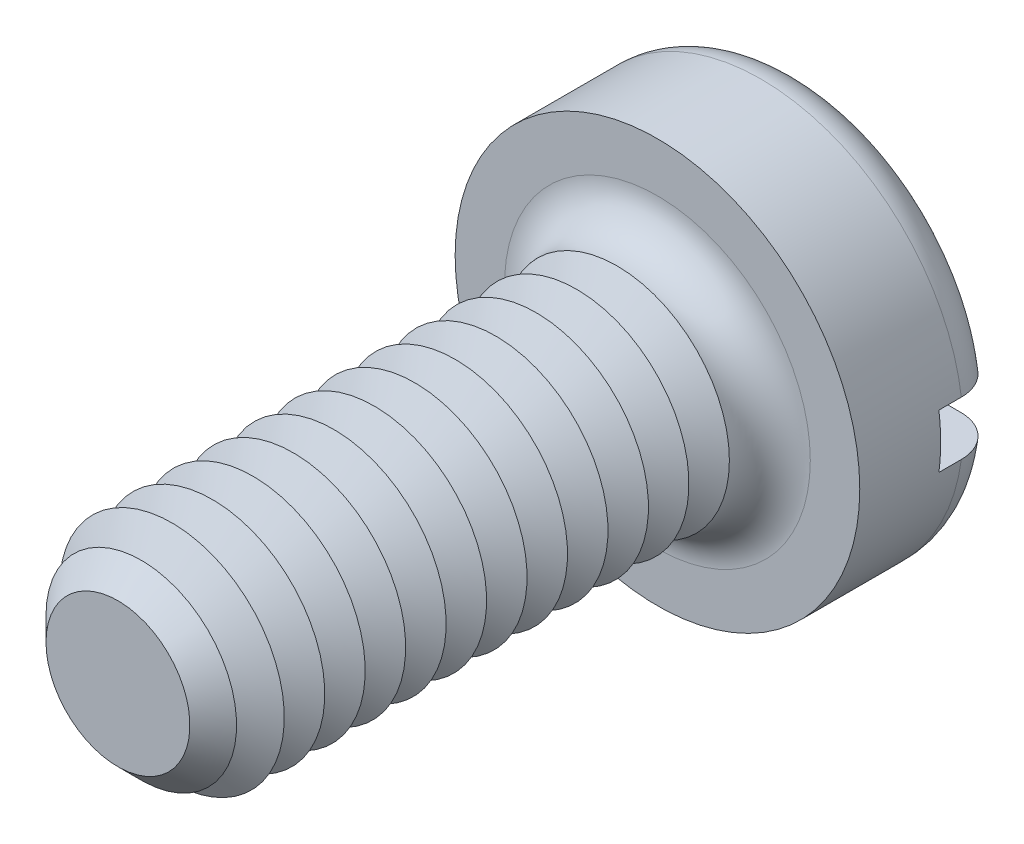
from build123d import *

# Parameters (mm, degrees)
SKETCH3_R           = 2.25
BOSS_EXTRUDE2_DEPTH = 1.6
SKETCH4_R           = 1.25
BOSS_EXTRUDE3_DEPTH = 6
FILLET1_R           = 0.45
CHAMFER1_SIZE       = 0.45
LPATTERN1_COUNT     = 12
LPATTERN1_PITCH     = 0.45
SKETCH8_W           = 4.5
SKETCH8_H           = 0.6
CUT_EXTRUDE1_DEPTH  = 0.7


with BuildPart() as part:
    # Sketch3 → Boss-Extrude2 (new body)
    with BuildSketch(Plane.XY):
        Circle(SKETCH3_R)
    extrude(amount=-BOSS_EXTRUDE2_DEPTH)

    # Sketch4 → Boss-Extrude3 (add)
    with BuildSketch(Plane.XY):
        Circle(SKETCH4_R)
    extrude(amount=BOSS_EXTRUDE3_DEPTH)

    # Fillet1
    fillet1_edges = [part.edges().sort_by_distance(p)[0] for p in [
        (-2.25, 0, -1.6),
        (-1.25, 0, 0),
    ]]
    fillet(fillet1_edges, radius=FILLET1_R)

    # Chamfer1
    chamfer1_edges = [part.edges().sort_by_distance(p)[0] for p in [
        (-1.25, 0, 6),
    ]]
    chamfer(chamfer1_edges, length=CHAMFER1_SIZE)

    # Sketch6 → Cut-Revolve1 (revolve, cut)
    with BuildSketch(Plane(origin=(0, 0, 0), x_dir=(0, 0, -1), z_dir=(1, 0, 0)), mode=Mode.PRIVATE) as cut_revolve1_sk:
        Polygon((-0.45, 1.25), (-0.675, 0.860288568), (-0.9, 1.25), align=None)
    cut_revolve1 = revolve(cut_revolve1_sk.sketch.rotate(Axis((0, 0, -1.694361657), (0, 0, 1)), 90), axis=Axis((0, 0, -1.694361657), (0, 0, 1)), mode=Mode.SUBTRACT)

    # LPattern1: Cut-Revolve1 ×12
    with Locations(*[(0, 0, i * LPATTERN1_PITCH) for i in range(1, LPATTERN1_COUNT)]):
        add(cut_revolve1, mode=Mode.SUBTRACT)

    # Sketch8 → Cut-Extrude1 (cut)
    with BuildSketch(Plane(origin=(0, 0, -1.6), x_dir=(-1, 0, 0), z_dir=(0, 0, -1))):
        Rectangle(SKETCH8_W, SKETCH8_H)
    extrude(amount=-CUT_EXTRUDE1_DEPTH, mode=Mode.SUBTRACT)


solid = part.part
